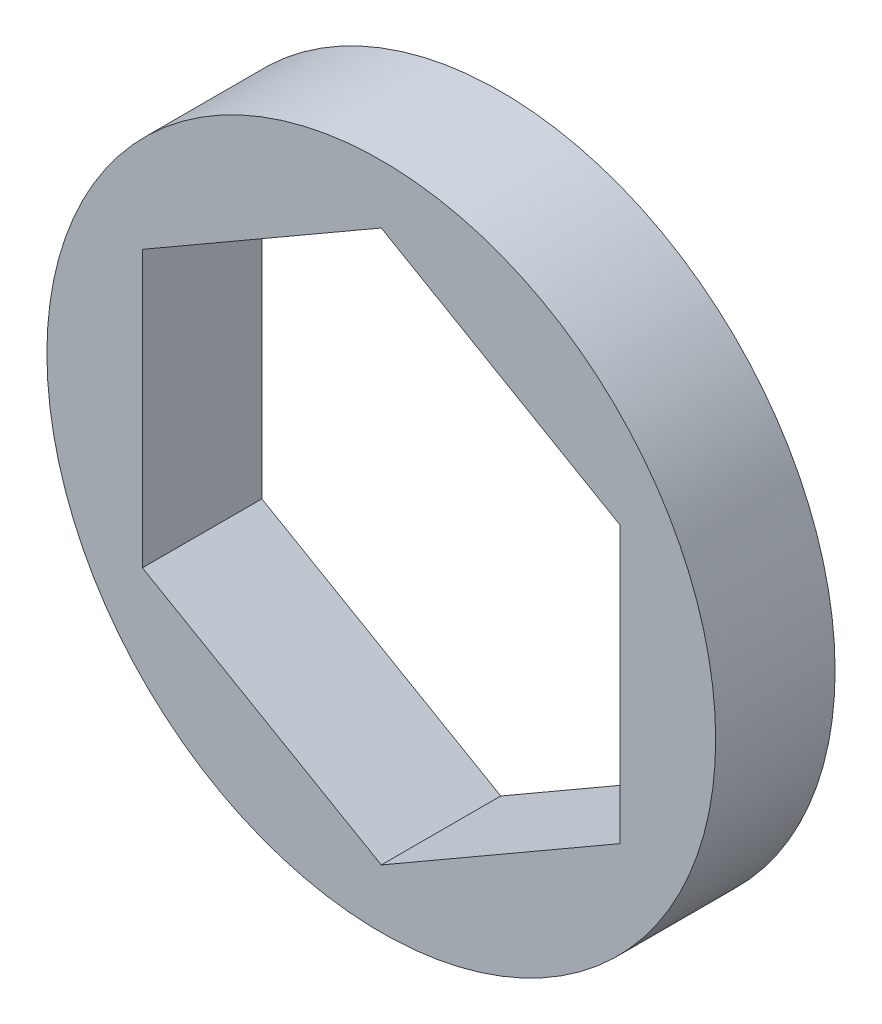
from build123d import *

# Parameters (mm, degrees)
SKETCH1_R           = 8.89
BOSS_EXTRUDE1_DEPTH = 3.175


with BuildPart() as part:
    # Sketch1 → Boss-Extrude1 (new body)
    with BuildSketch(Plane.XY):
        Circle(SKETCH1_R)
        Polygon((0, 7.332348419), (-6.35, 3.666174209), (-6.35, -3.666174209), (0, -7.332348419), (6.35, -3.666174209), (6.35, 3.666174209), align=None, mode=Mode.SUBTRACT)
    extrude(amount=BOSS_EXTRUDE1_DEPTH)


solid = part.part
